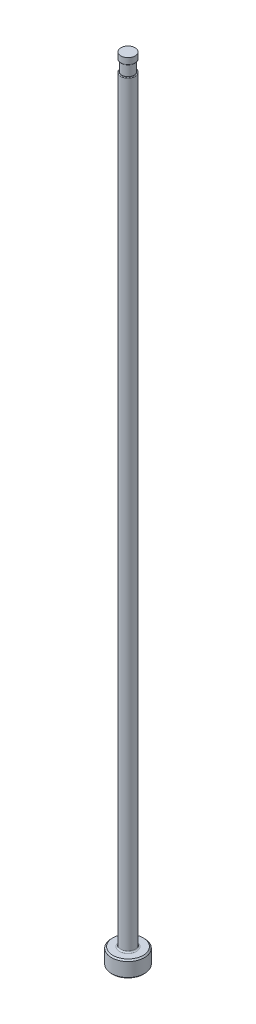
from build123d import *

# Parameters (mm, degrees)
CHAMFER1_SIZE     = 0.254
FILLET1_R         = 0.254
SKETCH2_W         = 0.2032
SKETCH2_H         = 2.032
D_SLOT_DEPTH      = 153.466131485
D_SLOT_DEPTH_BACK = 153.466131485
SKETCH5_W         = 0.0127
SKETCH5_H         = 1.27
FILLET2_R         = 0.127


with BuildPart() as part:
    # Sketch1 → Revolve1 (revolve)
    with BuildSketch(Plane.XY, mode=Mode.PRIVATE) as revolve1_sk:
        Polygon((0, 0), (-3.175, 0), (-3.175, 3.175), (-1.38811, 3.175), (-1.38811, 152.4), (0, 152.4), align=None)
    revolve(revolve1_sk.sketch.rotate(Axis((0, 259.958771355, 0), (0, -1, 0)), 270), axis=Axis((0, 259.958771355, 0), (0, -1, 0)))

    # Chamfer1
    chamfer1_edges = [part.edges().sort_by_distance(p)[0] for p in [
        (0, 3.175, -3.175),
        (0, 0, -3.175),
    ]]
    chamfer(chamfer1_edges, length=CHAMFER1_SIZE)

    # Fillet1
    fillet1_edges = [part.edges().sort_by_distance(p)[0] for p in [
        (0, 3.175, -1.38811),
    ]]
    fillet(fillet1_edges, radius=FILLET1_R)

    # Sketch2 → Vent Relief (revolve, cut)
    with BuildSketch(Plane.XY, mode=Mode.PRIVATE) as vent_relief_sk:
        with Locations((-1.28651, 150.114)):
            Rectangle(SKETCH2_W, SKETCH2_H)
    revolve(vent_relief_sk.sketch.rotate(Axis((0, 153.448281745, 0), (0, -1, 0)), 270), axis=Axis((0, 153.448281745, 0), (0, -1, 0)), mode=Mode.SUBTRACT)

    # Sketch3 → D-Slot (cut, two sides: drawn at the far end of the back side and taken through both)
    with BuildSketch(Plane.XY.offset(-D_SLOT_DEPTH_BACK)):
        with BuildLine():
            Line((-1.18491, 150.114), (-1.18491, 86.614))
            ThreePointArc((-1.18491, 86.614), (-1.236123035, 86.046038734), (-1.38811, 85.4964))
            Line((-1.38811, 85.4964), (-1.38811, 150.114))
            Line((-1.38811, 150.114), (-1.18491, 150.114))
        make_face()
    extrude(amount=D_SLOT_DEPTH + D_SLOT_DEPTH_BACK, mode=Mode.SUBTRACT)

    # Sketch5 → Vent Diameter (revolve, cut)
    with BuildSketch(Plane.XY, mode=Mode.PRIVATE) as vent_diameter_sk:
        with Locations((-1.38176, 151.765)):
            Rectangle(SKETCH5_W, SKETCH5_H)
    revolve(vent_diameter_sk.sketch.rotate(Axis((0, 152.687735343, 0), (0, -1, 0)), 90), axis=Axis((0, 152.687735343, 0), (0, -1, 0)), mode=Mode.SUBTRACT)

    # Fillet2
    fillet2_edges = [part.edges().sort_by_distance(p)[0] for p in [
        (1.210486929, 149.098, -0.679389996),
        (0, 151.13, 1.37541),
    ]]
    fillet(fillet2_edges, radius=FILLET2_R)


solid = part.part
